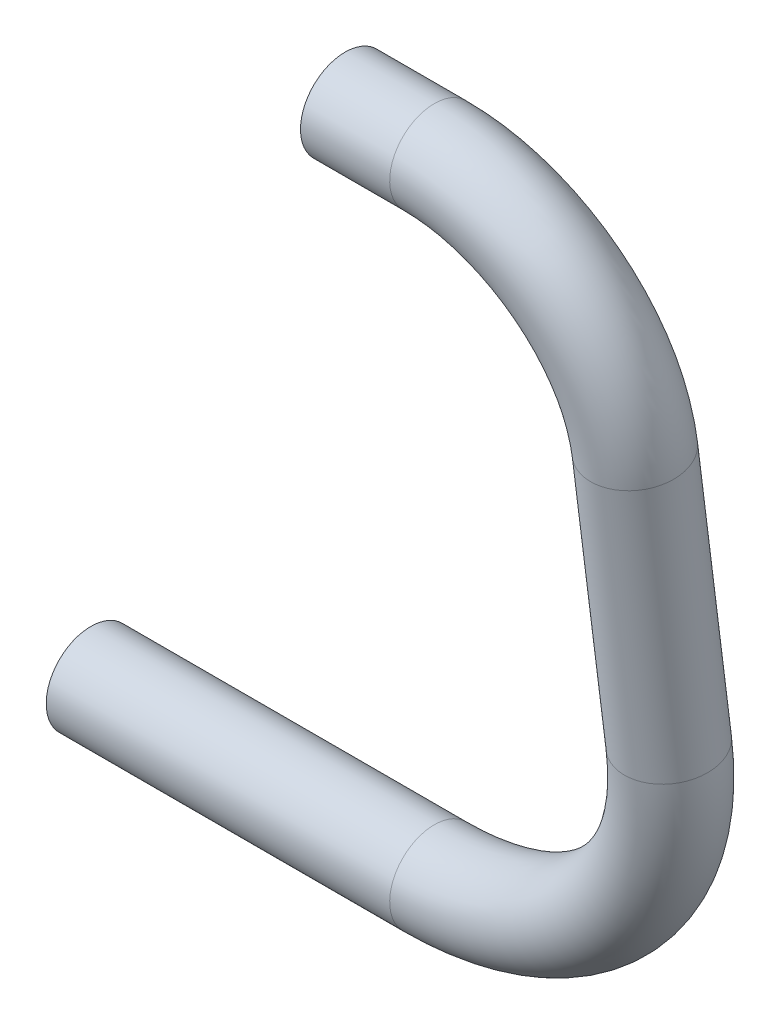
from build123d import *

# Parameters (mm, degrees)
SKETCH1_R = 3.175


with BuildPart() as part:
    # Sweep1: sweep along a curve in space
    with BuildLine() as sweep1_path:
        Line((0, 0, 0), (24.4475, 0, 0))
        ThreePointArc((24.4475, 0, 0), (37.917884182, 5.536529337, 0.692066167), (43.4975, 18.902893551, 2.362861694))
        Line((43.4975, 18.902893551, 2.362861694), (43.4975, 38.198070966, 4.774758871))
        ThreePointArc((43.4975, 38.198070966, 4.774758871), (39.777756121, 47.108980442, 5.888622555), (30.7975, 50.8, 6.35))
        Line((30.7975, 50.8, 6.35), (24.4475, 50.8, 6.35))
    # Sketch1 → Sweep1 (sweep)
    with BuildSketch(Plane(origin=(0, 0, 0), x_dir=(0, 0, -1), z_dir=(1, 0, 0))):
        Circle(SKETCH1_R)
    sweep(path=sweep1_path.line)


solid = part.part
